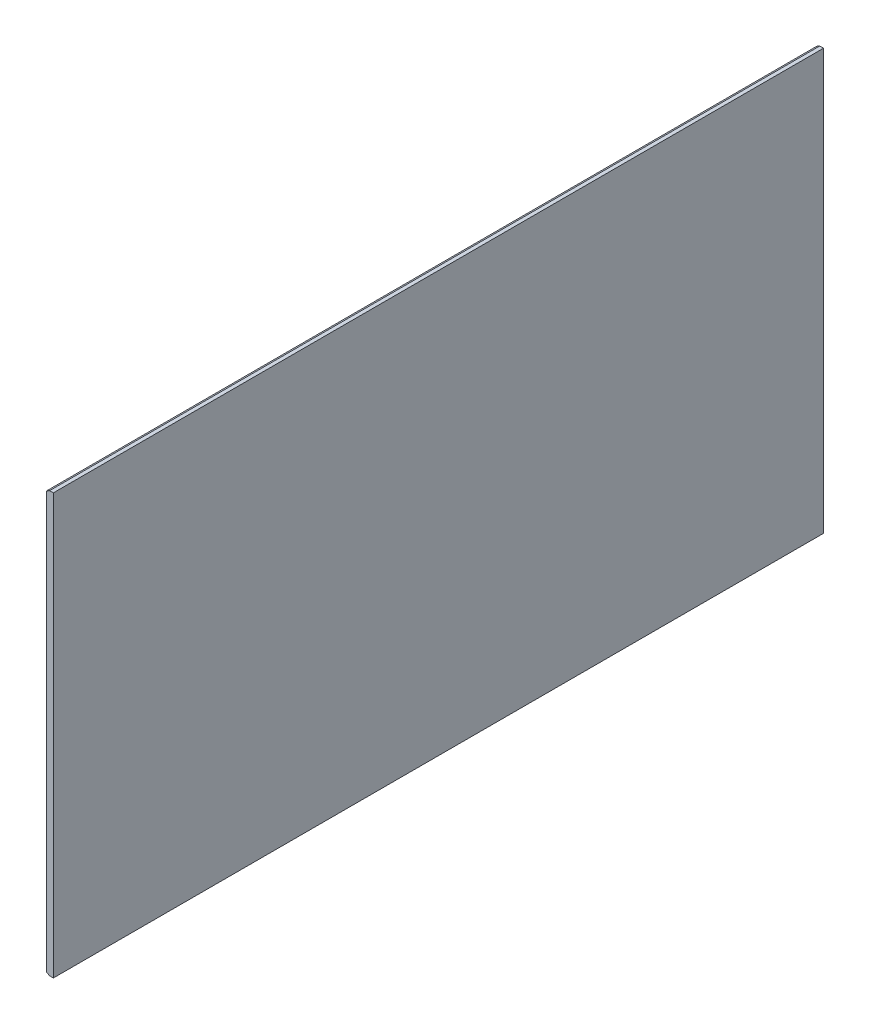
ISO-10303-21;
HEADER;
FILE_DESCRIPTION(('STEP AP214'),'2;1');
FILE_NAME('part.step','',(''),(''),'','','');
FILE_SCHEMA(('AUTOMOTIVE_DESIGN { 1 0 10303 214 1 1 1 1 }'));
ENDSEC;
DATA;
#1=APPLICATION_CONTEXT('core data for automotive mechanical design processes');
#2=APPLICATION_PROTOCOL_DEFINITION('international standard','automotive_design',2000,#1);
#3=PRODUCT_CONTEXT('',#1,'mechanical');
#4=PRODUCT('Part','Part','',(#3));
#5=PRODUCT_RELATED_PRODUCT_CATEGORY('part','',(#4));
#6=PRODUCT_DEFINITION_FORMATION('','',#4);
#7=PRODUCT_DEFINITION_CONTEXT('part definition',#1,'design');
#8=PRODUCT_DEFINITION('design','',#6,#7);
#9=PRODUCT_DEFINITION_SHAPE('','',#8);
#10=(LENGTH_UNIT() NAMED_UNIT(*) SI_UNIT(.MILLI.,.METRE.));
#11=(NAMED_UNIT(*) PLANE_ANGLE_UNIT() SI_UNIT($,.RADIAN.));
#12=(NAMED_UNIT(*) SI_UNIT($,.STERADIAN.) SOLID_ANGLE_UNIT());
#13=UNCERTAINTY_MEASURE_WITH_UNIT(LENGTH_MEASURE(1.E-05),#10,'distance_accuracy_value','');
#14=(GEOMETRIC_REPRESENTATION_CONTEXT(3) GLOBAL_UNCERTAINTY_ASSIGNED_CONTEXT((#13)) GLOBAL_UNIT_ASSIGNED_CONTEXT((#10,
#11,#12)) REPRESENTATION_CONTEXT('',''));
#15=CARTESIAN_POINT('',(0.,0.,0.));
#16=DIRECTION('',(0.,0.,1.));
#17=DIRECTION('',(1.,0.,0.));
#18=AXIS2_PLACEMENT_3D('',#15,#16,#17);
#19=CARTESIAN_POINT('',(9.525,579.,1061.35));
#20=DIRECTION('',(0.,-1.,0.));
#21=DIRECTION('',(0.,0.,-1.));
#22=AXIS2_PLACEMENT_3D('',#19,#20,#21);
#23=PLANE('',#22);
#24=DIRECTION('',(-1.,0.,0.));
#25=VECTOR('',#24,1.);
#26=CARTESIAN_POINT('',(9.525,579.,-1061.35));
#27=LINE('',#26,#25);
#28=CARTESIAN_POINT('',(9.525,579.,-1061.35));
#29=VERTEX_POINT('',#28);
#30=CARTESIAN_POINT('',(-0.864745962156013,579.,-1061.35));
#31=VERTEX_POINT('',#30);
#32=EDGE_CURVE('E152',#29,#31,#27,.T.);
#33=ORIENTED_EDGE('',*,*,#32,.T.);
#34=DIRECTION('',(0.,0.,1.));
#35=VECTOR('',#34,1.);
#36=CARTESIAN_POINT('',(-0.864745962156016,579.,1061.35));
#37=LINE('',#36,#35);
#38=CARTESIAN_POINT('',(-0.864745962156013,579.,1061.35));
#39=VERTEX_POINT('',#38);
#40=EDGE_CURVE('E130',#31,#39,#37,.T.);
#41=ORIENTED_EDGE('',*,*,#40,.T.);
#42=DIRECTION('',(-1.,0.,0.));
#43=VECTOR('',#42,1.);
#44=CARTESIAN_POINT('',(9.525,579.,1061.35));
#45=LINE('',#44,#43);
#46=CARTESIAN_POINT('',(9.525,579.,1061.35));
#47=VERTEX_POINT('',#46);
#48=EDGE_CURVE('E106',#47,#39,#45,.T.);
#49=ORIENTED_EDGE('',*,*,#48,.F.);
#50=DIRECTION('',(0.,0.,1.));
#51=VECTOR('',#50,1.);
#52=CARTESIAN_POINT('',(9.525,579.,1061.35));
#53=LINE('',#52,#51);
#54=EDGE_CURVE('E113',#29,#47,#53,.T.);
#55=ORIENTED_EDGE('',*,*,#54,.F.);
#56=EDGE_LOOP('',(#33,#41,#49,#55));
#57=FACE_BOUND('',#56,.T.);
#58=ADVANCED_FACE('F44',(#57),#23,.F.);
#59=CARTESIAN_POINT('',(9.525,-579.,1061.35));
#60=DIRECTION('',(0.,0.,-1.));
#61=DIRECTION('',(-1.,0.,0.));
#62=AXIS2_PLACEMENT_3D('',#59,#60,#61);
#63=PLANE('',#62);
#64=ORIENTED_EDGE('',*,*,#48,.T.);
#65=DIRECTION('',(0.866025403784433,0.500000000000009,0.));
#66=VECTOR('',#65,1.);
#67=CARTESIAN_POINT('',(-0.864745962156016,579.,1061.35));
#68=LINE('',#67,#66);
#69=CARTESIAN_POINT('',(-9.525,574.,1061.35));
#70=VERTEX_POINT('',#69);
#71=EDGE_CURVE('E142',#39,#70,#68,.F.);
#72=ORIENTED_EDGE('',*,*,#71,.T.);
#73=DIRECTION('',(0.,-1.,0.));
#74=VECTOR('',#73,1.);
#75=CARTESIAN_POINT('',(-9.525,-579.,1061.35));
#76=LINE('',#75,#74);
#77=CARTESIAN_POINT('',(-9.525,-574.,1061.35));
#78=VERTEX_POINT('',#77);
#79=EDGE_CURVE('E163',#70,#78,#76,.T.);
#80=ORIENTED_EDGE('',*,*,#79,.T.);
#81=DIRECTION('',(-0.866025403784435,0.500000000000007,0.));
#82=VECTOR('',#81,1.);
#83=CARTESIAN_POINT('',(-0.864745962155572,-579.,1061.35));
#84=LINE('',#83,#82);
#85=CARTESIAN_POINT('',(-0.864745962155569,-579.,1061.35));
#86=VERTEX_POINT('',#85);
#87=EDGE_CURVE('E131',#78,#86,#84,.F.);
#88=ORIENTED_EDGE('',*,*,#87,.T.);
#89=DIRECTION('',(-1.,0.,0.));
#90=VECTOR('',#89,1.);
#91=CARTESIAN_POINT('',(9.525,-579.,1061.35));
#92=LINE('',#91,#90);
#93=CARTESIAN_POINT('',(9.525,-579.,1061.35));
#94=VERTEX_POINT('',#93);
#95=EDGE_CURVE('E108',#94,#86,#92,.T.);
#96=ORIENTED_EDGE('',*,*,#95,.F.);
#97=DIRECTION('',(0.,-1.,0.));
#98=VECTOR('',#97,1.);
#99=CARTESIAN_POINT('',(9.525,-579.,1061.35));
#100=LINE('',#99,#98);
#101=EDGE_CURVE('E105',#47,#94,#100,.T.);
#102=ORIENTED_EDGE('',*,*,#101,.F.);
#103=EDGE_LOOP('',(#64,#72,#80,#88,#96,#102));
#104=FACE_BOUND('',#103,.T.);
#105=ADVANCED_FACE('F104',(#104),#63,.F.);
#106=CARTESIAN_POINT('',(9.525,-579.,1061.35));
#107=DIRECTION('',(0.,1.,0.));
#108=DIRECTION('',(0.,0.,1.));
#109=AXIS2_PLACEMENT_3D('',#106,#107,#108);
#110=PLANE('',#109);
#111=ORIENTED_EDGE('',*,*,#95,.T.);
#112=DIRECTION('',(0.,0.,-1.));
#113=VECTOR('',#112,1.);
#114=CARTESIAN_POINT('',(-0.864745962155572,-579.,1061.35));
#115=LINE('',#114,#113);
#116=CARTESIAN_POINT('',(-0.864745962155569,-579.,-1061.35));
#117=VERTEX_POINT('',#116);
#118=EDGE_CURVE('E11',#86,#117,#115,.T.);
#119=ORIENTED_EDGE('',*,*,#118,.T.);
#120=DIRECTION('',(-1.,0.,0.));
#121=VECTOR('',#120,1.);
#122=CARTESIAN_POINT('',(9.525,-579.,-1061.35));
#123=LINE('',#122,#121);
#124=CARTESIAN_POINT('',(9.525,-579.,-1061.35));
#125=VERTEX_POINT('',#124);
#126=EDGE_CURVE('E132',#125,#117,#123,.T.);
#127=ORIENTED_EDGE('',*,*,#126,.F.);
#128=DIRECTION('',(0.,0.,-1.));
#129=VECTOR('',#128,1.);
#130=CARTESIAN_POINT('',(9.525,-579.,1061.35));
#131=LINE('',#130,#129);
#132=EDGE_CURVE('E115',#94,#125,#131,.T.);
#133=ORIENTED_EDGE('',*,*,#132,.F.);
#134=EDGE_LOOP('',(#111,#119,#127,#133));
#135=FACE_BOUND('',#134,.T.);
#136=ADVANCED_FACE('F176',(#135),#110,.F.);
#137=CARTESIAN_POINT('',(9.525,-579.,-1061.35));
#138=DIRECTION('',(0.,0.,1.));
#139=DIRECTION('',(1.,0.,0.));
#140=AXIS2_PLACEMENT_3D('',#137,#138,#139);
#141=PLANE('',#140);
#142=DIRECTION('',(0.,1.,0.));
#143=VECTOR('',#142,1.);
#144=CARTESIAN_POINT('',(-9.525,-579.,-1061.35));
#145=LINE('',#144,#143);
#146=CARTESIAN_POINT('',(-9.525,-574.,-1061.35));
#147=VERTEX_POINT('',#146);
#148=CARTESIAN_POINT('',(-9.525,574.,-1061.35));
#149=VERTEX_POINT('',#148);
#150=EDGE_CURVE('E124',#147,#149,#145,.T.);
#151=ORIENTED_EDGE('',*,*,#150,.T.);
#152=DIRECTION('',(-0.866025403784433,-0.500000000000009,0.));
#153=VECTOR('',#152,1.);
#154=CARTESIAN_POINT('',(-0.864745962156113,579.,-1061.35));
#155=LINE('',#154,#153);
#156=EDGE_CURVE('E54',#149,#31,#155,.F.);
#157=ORIENTED_EDGE('',*,*,#156,.T.);
#158=ORIENTED_EDGE('',*,*,#32,.F.);
#159=DIRECTION('',(0.,1.,0.));
#160=VECTOR('',#159,1.);
#161=CARTESIAN_POINT('',(9.525,-579.,-1061.35));
#162=LINE('',#161,#160);
#163=EDGE_CURVE('E117',#125,#29,#162,.T.);
#164=ORIENTED_EDGE('',*,*,#163,.F.);
#165=ORIENTED_EDGE('',*,*,#126,.T.);
#166=DIRECTION('',(0.866025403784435,-0.500000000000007,0.));
#167=VECTOR('',#166,1.);
#168=CARTESIAN_POINT('',(-0.864745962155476,-579.,-1061.35));
#169=LINE('',#168,#167);
#170=EDGE_CURVE('E65',#117,#147,#169,.F.);
#171=ORIENTED_EDGE('',*,*,#170,.T.);
#172=EDGE_LOOP('',(#151,#157,#158,#164,#165,#171));
#173=FACE_BOUND('',#172,.T.);
#174=ADVANCED_FACE('F154',(#173),#141,.F.);
#175=CARTESIAN_POINT('',(9.525,0.,0.));
#176=DIRECTION('',(1.,0.,0.));
#177=DIRECTION('',(0.,0.,-1.));
#178=AXIS2_PLACEMENT_3D('',#175,#176,#177);
#179=PLANE('',#178);
#180=ORIENTED_EDGE('',*,*,#54,.T.);
#181=ORIENTED_EDGE('',*,*,#101,.T.);
#182=ORIENTED_EDGE('',*,*,#132,.T.);
#183=ORIENTED_EDGE('',*,*,#163,.T.);
#184=EDGE_LOOP('',(#180,#181,#182,#183));
#185=FACE_BOUND('',#184,.T.);
#186=ADVANCED_FACE('F116',(#185),#179,.T.);
#187=CARTESIAN_POINT('',(-9.525,0.,0.));
#188=DIRECTION('',(1.,0.,0.));
#189=DIRECTION('',(0.,0.,-1.));
#190=AXIS2_PLACEMENT_3D('',#187,#188,#189);
#191=PLANE('',#190);
#192=ORIENTED_EDGE('',*,*,#79,.F.);
#193=DIRECTION('',(0.,0.,-1.));
#194=VECTOR('',#193,1.);
#195=CARTESIAN_POINT('',(-9.525,574.,0.));
#196=LINE('',#195,#194);
#197=EDGE_CURVE('E69',#70,#149,#196,.T.);
#198=ORIENTED_EDGE('',*,*,#197,.T.);
#199=ORIENTED_EDGE('',*,*,#150,.F.);
#200=DIRECTION('',(0.,0.,1.));
#201=VECTOR('',#200,1.);
#202=CARTESIAN_POINT('',(-9.525,-574.,0.));
#203=LINE('',#202,#201);
#204=EDGE_CURVE('E144',#147,#78,#203,.T.);
#205=ORIENTED_EDGE('',*,*,#204,.T.);
#206=EDGE_LOOP('',(#192,#198,#199,#205));
#207=FACE_BOUND('',#206,.T.);
#208=ADVANCED_FACE('F161',(#207),#191,.F.);
#209=CARTESIAN_POINT('',(-0.864745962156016,579.,1061.35));
#210=DIRECTION('',(0.500000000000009,-0.866025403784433,0.));
#211=DIRECTION('',(0.,0.,1.));
#212=AXIS2_PLACEMENT_3D('',#209,#210,#211);
#213=PLANE('',#212);
#214=ORIENTED_EDGE('',*,*,#156,.F.);
#215=ORIENTED_EDGE('',*,*,#197,.F.);
#216=ORIENTED_EDGE('',*,*,#71,.F.);
#217=ORIENTED_EDGE('',*,*,#40,.F.);
#218=EDGE_LOOP('',(#214,#215,#216,#217));
#219=FACE_BOUND('',#218,.T.);
#220=ADVANCED_FACE('F159',(#219),#213,.F.);
#221=CARTESIAN_POINT('',(-0.864745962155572,-579.,1061.35));
#222=DIRECTION('',(0.500000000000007,0.866025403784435,0.));
#223=DIRECTION('',(0.,0.,-1.));
#224=AXIS2_PLACEMENT_3D('',#221,#222,#223);
#225=PLANE('',#224);
#226=ORIENTED_EDGE('',*,*,#87,.F.);
#227=ORIENTED_EDGE('',*,*,#204,.F.);
#228=ORIENTED_EDGE('',*,*,#170,.F.);
#229=ORIENTED_EDGE('',*,*,#118,.F.);
#230=EDGE_LOOP('',(#226,#227,#228,#229));
#231=FACE_BOUND('',#230,.T.);
#232=ADVANCED_FACE('F48',(#231),#225,.F.);
#233=CLOSED_SHELL('',(#58,#105,#136,#174,#186,#208,#220,#232));
#234=MANIFOLD_SOLID_BREP('B2',#233);
#235=ADVANCED_BREP_SHAPE_REPRESENTATION('',(#18,#234),#14);
#236=SHAPE_DEFINITION_REPRESENTATION(#9,#235);
ENDSEC;
END-ISO-10303-21;
